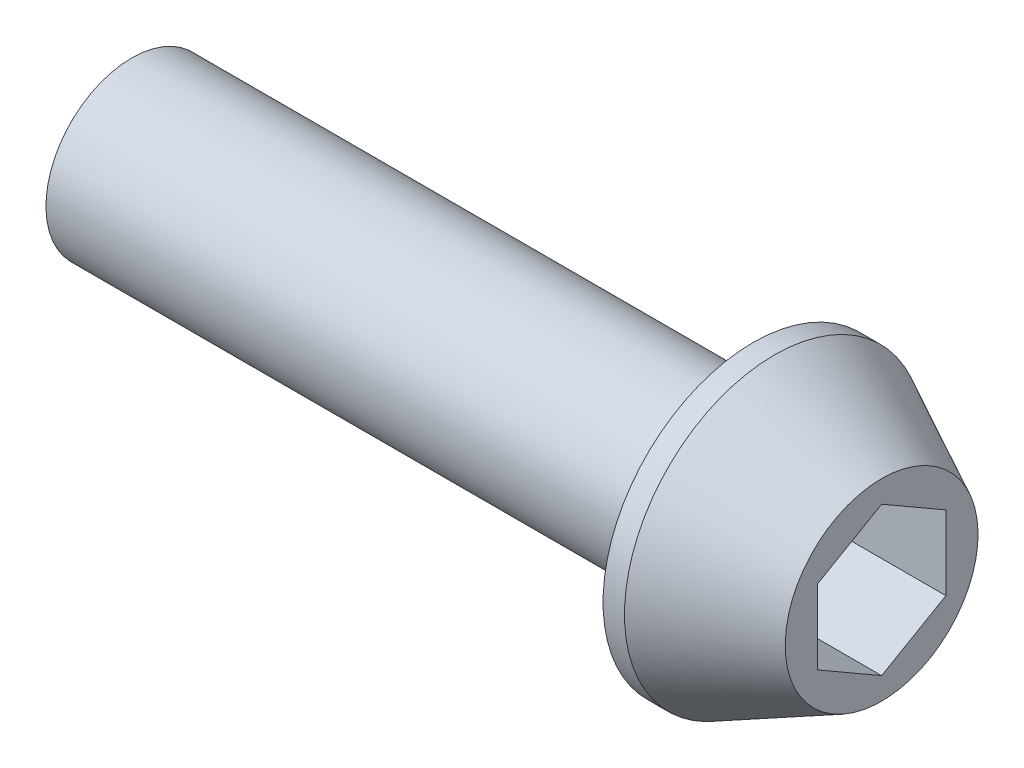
ISO-10303-21;
HEADER;
FILE_DESCRIPTION(('STEP AP214'),'2;1');
FILE_NAME('part.step','',(''),(''),'','','');
FILE_SCHEMA(('AUTOMOTIVE_DESIGN { 1 0 10303 214 1 1 1 1 }'));
ENDSEC;
DATA;
#1=APPLICATION_CONTEXT('core data for automotive mechanical design processes');
#2=APPLICATION_PROTOCOL_DEFINITION('international standard','automotive_design',2000,#1);
#3=PRODUCT_CONTEXT('',#1,'mechanical');
#4=PRODUCT('Part','Part','',(#3));
#5=PRODUCT_RELATED_PRODUCT_CATEGORY('part','',(#4));
#6=PRODUCT_DEFINITION_FORMATION('','',#4);
#7=PRODUCT_DEFINITION_CONTEXT('part definition',#1,'design');
#8=PRODUCT_DEFINITION('design','',#6,#7);
#9=PRODUCT_DEFINITION_SHAPE('','',#8);
#10=(LENGTH_UNIT() NAMED_UNIT(*) SI_UNIT(.MILLI.,.METRE.));
#11=(NAMED_UNIT(*) PLANE_ANGLE_UNIT() SI_UNIT($,.RADIAN.));
#12=(NAMED_UNIT(*) SI_UNIT($,.STERADIAN.) SOLID_ANGLE_UNIT());
#13=UNCERTAINTY_MEASURE_WITH_UNIT(LENGTH_MEASURE(1.E-05),#10,'distance_accuracy_value','');
#14=(GEOMETRIC_REPRESENTATION_CONTEXT(3) GLOBAL_UNCERTAINTY_ASSIGNED_CONTEXT((#13)) GLOBAL_UNIT_ASSIGNED_CONTEXT((#10,
#11,#12)) REPRESENTATION_CONTEXT('',''));
#15=CARTESIAN_POINT('',(0.,0.,0.));
#16=DIRECTION('',(0.,0.,1.));
#17=DIRECTION('',(1.,0.,0.));
#18=AXIS2_PLACEMENT_3D('',#15,#16,#17);
#19=CARTESIAN_POINT('',(-6.,3.,0.));
#20=DIRECTION('',(-1.,0.,0.));
#21=DIRECTION('',(0.,-1.,0.));
#22=AXIS2_PLACEMENT_3D('',#19,#20,#21);
#23=PLANE('',#22);
#24=CARTESIAN_POINT('',(-6.,0.,0.));
#25=DIRECTION('',(1.,0.,0.));
#26=DIRECTION('',(0.,1.,0.));
#27=AXIS2_PLACEMENT_3D('',#24,#25,#26);
#28=CIRCLE('',#27,3.);
#29=CARTESIAN_POINT('',(-6.,3.,0.));
#30=VERTEX_POINT('',#29);
#31=EDGE_CURVE('E133',#30,#30,#28,.T.);
#32=ORIENTED_EDGE('',*,*,#31,.F.);
#33=EDGE_LOOP('',(#32));
#34=FACE_BOUND('',#33,.T.);
#35=ADVANCED_FACE('F32',(#34),#23,.T.);
#36=CARTESIAN_POINT('',(0.,4.5,0.));
#37=DIRECTION('',(1.,0.,0.));
#38=DIRECTION('',(0.,1.,0.));
#39=AXIS2_PLACEMENT_3D('',#36,#37,#38);
#40=PLANE('',#39);
#41=DIRECTION('',(0.,0.5,0.866025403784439));
#42=VECTOR('',#41,1.);
#43=CARTESIAN_POINT('',(0.,1.73205080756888,-3.));
#44=LINE('',#43,#42);
#45=CARTESIAN_POINT('',(0.,1.73205080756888,-3.));
#46=VERTEX_POINT('',#45);
#47=CARTESIAN_POINT('',(0.,3.46410161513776,0.));
#48=VERTEX_POINT('',#47);
#49=EDGE_CURVE('E46',#46,#48,#44,.T.);
#50=ORIENTED_EDGE('',*,*,#49,.F.);
#51=DIRECTION('',(0.,1.,0.));
#52=VECTOR('',#51,1.);
#53=CARTESIAN_POINT('',(0.,-1.73205080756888,-3.));
#54=LINE('',#53,#52);
#55=CARTESIAN_POINT('',(0.,-1.73205080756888,-3.));
#56=VERTEX_POINT('',#55);
#57=EDGE_CURVE('E129',#56,#46,#54,.T.);
#58=ORIENTED_EDGE('',*,*,#57,.F.);
#59=DIRECTION('',(0.,0.5,-0.866025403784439));
#60=VECTOR('',#59,1.);
#61=CARTESIAN_POINT('',(0.,-3.46410161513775,0.));
#62=LINE('',#61,#60);
#63=CARTESIAN_POINT('',(0.,-3.46410161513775,0.));
#64=VERTEX_POINT('',#63);
#65=EDGE_CURVE('E127',#64,#56,#62,.T.);
#66=ORIENTED_EDGE('',*,*,#65,.F.);
#67=DIRECTION('',(0.,-0.5,-0.866025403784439));
#68=VECTOR('',#67,1.);
#69=CARTESIAN_POINT('',(0.,-1.73205080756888,3.));
#70=LINE('',#69,#68);
#71=CARTESIAN_POINT('',(0.,-1.73205080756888,3.));
#72=VERTEX_POINT('',#71);
#73=EDGE_CURVE('E94',#72,#64,#70,.T.);
#74=ORIENTED_EDGE('',*,*,#73,.F.);
#75=DIRECTION('',(0.,-1.,0.));
#76=VECTOR('',#75,1.);
#77=CARTESIAN_POINT('',(0.,1.73205080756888,3.));
#78=LINE('',#77,#76);
#79=CARTESIAN_POINT('',(0.,1.73205080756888,3.));
#80=VERTEX_POINT('',#79);
#81=EDGE_CURVE('E123',#80,#72,#78,.T.);
#82=ORIENTED_EDGE('',*,*,#81,.F.);
#83=DIRECTION('',(0.,-0.5,0.866025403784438));
#84=VECTOR('',#83,1.);
#85=CARTESIAN_POINT('',(0.,3.46410161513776,0.));
#86=LINE('',#85,#84);
#87=EDGE_CURVE('E120',#48,#80,#86,.T.);
#88=ORIENTED_EDGE('',*,*,#87,.F.);
#89=EDGE_LOOP('',(#50,#58,#66,#74,#82,#88));
#90=FACE_BOUND('',#89,.T.);
#91=CARTESIAN_POINT('',(0.,0.,0.));
#92=DIRECTION('',(1.,0.,0.));
#93=DIRECTION('',(0.,1.,0.));
#94=AXIS2_PLACEMENT_3D('',#91,#92,#93);
#95=CIRCLE('',#94,4.5);
#96=CARTESIAN_POINT('',(0.,4.5,0.));
#97=VERTEX_POINT('',#96);
#98=EDGE_CURVE('E11',#97,#97,#95,.T.);
#99=ORIENTED_EDGE('',*,*,#98,.T.);
#100=EDGE_LOOP('',(#99));
#101=FACE_BOUND('',#100,.T.);
#102=ADVANCED_FACE('F170',(#90,#101),#40,.T.);
#103=CARTESIAN_POINT('',(0.,0.,0.));
#104=DIRECTION('',(-1.,0.,0.));
#105=DIRECTION('',(0.,-1.,0.));
#106=AXIS2_PLACEMENT_3D('',#103,#104,#105);
#107=CONICAL_SURFACE('',#106,4.5,0.463647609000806);
#108=CARTESIAN_POINT('',(-5.,0.,0.));
#109=DIRECTION('',(1.,0.,0.));
#110=DIRECTION('',(0.,1.,0.));
#111=AXIS2_PLACEMENT_3D('',#108,#109,#110);
#112=CIRCLE('',#111,7.);
#113=CARTESIAN_POINT('',(-5.,7.,0.));
#114=VERTEX_POINT('',#113);
#115=EDGE_CURVE('E39',#114,#114,#112,.T.);
#116=ORIENTED_EDGE('',*,*,#115,.T.);
#117=EDGE_LOOP('',(#116));
#118=FACE_BOUND('',#117,.T.);
#119=ORIENTED_EDGE('',*,*,#98,.F.);
#120=EDGE_LOOP('',(#119));
#121=FACE_BOUND('',#120,.T.);
#122=ADVANCED_FACE('F155',(#118,#121),#107,.T.);
#123=CARTESIAN_POINT('',(0.,0.,0.));
#124=DIRECTION('',(1.,0.,0.));
#125=DIRECTION('',(0.,1.,0.));
#126=AXIS2_PLACEMENT_3D('',#123,#124,#125);
#127=CYLINDRICAL_SURFACE('',#126,7.);
#128=CARTESIAN_POINT('',(-6.,0.,0.));
#129=DIRECTION('',(1.,0.,0.));
#130=DIRECTION('',(0.,1.,0.));
#131=AXIS2_PLACEMENT_3D('',#128,#129,#130);
#132=CIRCLE('',#131,7.);
#133=CARTESIAN_POINT('',(-6.,7.,0.));
#134=VERTEX_POINT('',#133);
#135=EDGE_CURVE('E150',#134,#134,#132,.T.);
#136=ORIENTED_EDGE('',*,*,#135,.T.);
#137=EDGE_LOOP('',(#136));
#138=FACE_BOUND('',#137,.T.);
#139=ORIENTED_EDGE('',*,*,#115,.F.);
#140=EDGE_LOOP('',(#139));
#141=FACE_BOUND('',#140,.T.);
#142=ADVANCED_FACE('F158',(#138,#141),#127,.T.);
#143=CARTESIAN_POINT('',(-6.,3.99999999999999,0.));
#144=DIRECTION('',(-1.,0.,0.));
#145=DIRECTION('',(0.,-1.,0.));
#146=AXIS2_PLACEMENT_3D('',#143,#144,#145);
#147=PLANE('',#146);
#148=CARTESIAN_POINT('',(-6.,0.,0.));
#149=DIRECTION('',(1.,0.,0.));
#150=DIRECTION('',(0.,1.,0.));
#151=AXIS2_PLACEMENT_3D('',#148,#149,#150);
#152=CIRCLE('',#151,3.99999999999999);
#153=CARTESIAN_POINT('',(-6.,3.99999999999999,0.));
#154=VERTEX_POINT('',#153);
#155=EDGE_CURVE('E147',#154,#154,#152,.T.);
#156=ORIENTED_EDGE('',*,*,#155,.T.);
#157=EDGE_LOOP('',(#156));
#158=FACE_BOUND('',#157,.T.);
#159=ORIENTED_EDGE('',*,*,#135,.F.);
#160=EDGE_LOOP('',(#159));
#161=FACE_BOUND('',#160,.T.);
#162=ADVANCED_FACE('F160',(#158,#161),#147,.T.);
#163=CARTESIAN_POINT('',(0.,0.,0.));
#164=DIRECTION('',(1.,0.,0.));
#165=DIRECTION('',(0.,1.,0.));
#166=AXIS2_PLACEMENT_3D('',#163,#164,#165);
#167=CYLINDRICAL_SURFACE('',#166,3.99999999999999);
#168=CARTESIAN_POINT('',(-35.,0.,0.));
#169=DIRECTION('',(1.,0.,0.));
#170=DIRECTION('',(0.,1.,0.));
#171=AXIS2_PLACEMENT_3D('',#168,#169,#170);
#172=CIRCLE('',#171,4.);
#173=CARTESIAN_POINT('',(-35.,3.99999999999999,0.));
#174=VERTEX_POINT('',#173);
#175=EDGE_CURVE('E144',#174,#174,#172,.T.);
#176=ORIENTED_EDGE('',*,*,#175,.T.);
#177=EDGE_LOOP('',(#176));
#178=FACE_BOUND('',#177,.T.);
#179=ORIENTED_EDGE('',*,*,#155,.F.);
#180=EDGE_LOOP('',(#179));
#181=FACE_BOUND('',#180,.T.);
#182=ADVANCED_FACE('F167',(#178,#181),#167,.T.);
#183=CARTESIAN_POINT('',(-35.,3.99999999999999,0.));
#184=DIRECTION('',(-1.,0.,0.));
#185=DIRECTION('',(0.,-1.,0.));
#186=AXIS2_PLACEMENT_3D('',#183,#184,#185);
#187=PLANE('',#186);
#188=CARTESIAN_POINT('',(-35.,0.,0.));
#189=DIRECTION('',(1.,0.,0.));
#190=DIRECTION('',(0.,1.,0.));
#191=AXIS2_PLACEMENT_3D('',#188,#189,#190);
#192=CIRCLE('',#191,3.);
#193=CARTESIAN_POINT('',(-35.,2.99999999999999,0.));
#194=VERTEX_POINT('',#193);
#195=EDGE_CURVE('E141',#194,#194,#192,.T.);
#196=ORIENTED_EDGE('',*,*,#195,.T.);
#197=EDGE_LOOP('',(#196));
#198=FACE_BOUND('',#197,.T.);
#199=ORIENTED_EDGE('',*,*,#175,.F.);
#200=EDGE_LOOP('',(#199));
#201=FACE_BOUND('',#200,.T.);
#202=ADVANCED_FACE('F184',(#198,#201),#187,.T.);
#203=CARTESIAN_POINT('',(0.,0.,0.));
#204=DIRECTION('',(1.,0.,0.));
#205=DIRECTION('',(0.,1.,0.));
#206=AXIS2_PLACEMENT_3D('',#203,#204,#205);
#207=CYLINDRICAL_SURFACE('',#206,3.);
#208=ORIENTED_EDGE('',*,*,#31,.T.);
#209=EDGE_LOOP('',(#208));
#210=FACE_BOUND('',#209,.T.);
#211=ORIENTED_EDGE('',*,*,#195,.F.);
#212=EDGE_LOOP('',(#211));
#213=FACE_BOUND('',#212,.T.);
#214=ADVANCED_FACE('F180',(#210,#213),#207,.F.);
#215=CARTESIAN_POINT('',(-5.,1.73205080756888,-3.));
#216=DIRECTION('',(0.,0.866025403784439,-0.5));
#217=DIRECTION('',(0.,0.5,0.866025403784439));
#218=AXIS2_PLACEMENT_3D('',#215,#216,#217);
#219=PLANE('',#218);
#220=ORIENTED_EDGE('',*,*,#49,.T.);
#221=DIRECTION('',(1.,0.,0.));
#222=VECTOR('',#221,1.);
#223=CARTESIAN_POINT('',(-5.,3.46410161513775,0.));
#224=LINE('',#223,#222);
#225=CARTESIAN_POINT('',(-5.,3.46410161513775,0.));
#226=VERTEX_POINT('',#225);
#227=EDGE_CURVE('E76',#226,#48,#224,.T.);
#228=ORIENTED_EDGE('',*,*,#227,.F.);
#229=DIRECTION('',(0.,0.5,0.866025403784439));
#230=VECTOR('',#229,1.);
#231=CARTESIAN_POINT('',(-5.,1.73205080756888,-3.));
#232=LINE('',#231,#230);
#233=CARTESIAN_POINT('',(-5.,1.73205080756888,-3.));
#234=VERTEX_POINT('',#233);
#235=EDGE_CURVE('E131',#234,#226,#232,.T.);
#236=ORIENTED_EDGE('',*,*,#235,.F.);
#237=DIRECTION('',(1.,0.,0.));
#238=VECTOR('',#237,1.);
#239=CARTESIAN_POINT('',(-5.,1.73205080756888,-3.));
#240=LINE('',#239,#238);
#241=EDGE_CURVE('E54',#234,#46,#240,.T.);
#242=ORIENTED_EDGE('',*,*,#241,.T.);
#243=EDGE_LOOP('',(#220,#228,#236,#242));
#244=FACE_BOUND('',#243,.T.);
#245=ADVANCED_FACE('F183',(#244),#219,.F.);
#246=CARTESIAN_POINT('',(-5.,-1.73205080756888,-3.));
#247=DIRECTION('',(0.,0.,-1.));
#248=DIRECTION('',(0.,1.,0.));
#249=AXIS2_PLACEMENT_3D('',#246,#247,#248);
#250=PLANE('',#249);
#251=ORIENTED_EDGE('',*,*,#57,.T.);
#252=ORIENTED_EDGE('',*,*,#241,.F.);
#253=DIRECTION('',(0.,1.,0.));
#254=VECTOR('',#253,1.);
#255=CARTESIAN_POINT('',(-5.,-1.73205080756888,-3.));
#256=LINE('',#255,#254);
#257=CARTESIAN_POINT('',(-5.,-1.73205080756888,-3.));
#258=VERTEX_POINT('',#257);
#259=EDGE_CURVE('E106',#258,#234,#256,.T.);
#260=ORIENTED_EDGE('',*,*,#259,.F.);
#261=DIRECTION('',(1.,0.,0.));
#262=VECTOR('',#261,1.);
#263=CARTESIAN_POINT('',(-5.,-1.73205080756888,-3.));
#264=LINE('',#263,#262);
#265=EDGE_CURVE('E98',#258,#56,#264,.T.);
#266=ORIENTED_EDGE('',*,*,#265,.T.);
#267=EDGE_LOOP('',(#251,#252,#260,#266));
#268=FACE_BOUND('',#267,.T.);
#269=ADVANCED_FACE('F204',(#268),#250,.F.);
#270=CARTESIAN_POINT('',(-5.,-3.46410161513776,0.));
#271=DIRECTION('',(0.,-0.866025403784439,-0.5));
#272=DIRECTION('',(0.,0.5,-0.866025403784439));
#273=AXIS2_PLACEMENT_3D('',#270,#271,#272);
#274=PLANE('',#273);
#275=ORIENTED_EDGE('',*,*,#65,.T.);
#276=ORIENTED_EDGE('',*,*,#265,.F.);
#277=DIRECTION('',(0.,0.5,-0.866025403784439));
#278=VECTOR('',#277,1.);
#279=CARTESIAN_POINT('',(-5.,-3.46410161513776,0.));
#280=LINE('',#279,#278);
#281=CARTESIAN_POINT('',(-5.,-3.46410161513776,0.));
#282=VERTEX_POINT('',#281);
#283=EDGE_CURVE('E102',#282,#258,#280,.T.);
#284=ORIENTED_EDGE('',*,*,#283,.F.);
#285=DIRECTION('',(1.,0.,0.));
#286=VECTOR('',#285,1.);
#287=CARTESIAN_POINT('',(-5.,-3.46410161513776,0.));
#288=LINE('',#287,#286);
#289=EDGE_CURVE('E87',#282,#64,#288,.T.);
#290=ORIENTED_EDGE('',*,*,#289,.T.);
#291=EDGE_LOOP('',(#275,#276,#284,#290));
#292=FACE_BOUND('',#291,.T.);
#293=ADVANCED_FACE('F103',(#292),#274,.F.);
#294=CARTESIAN_POINT('',(-5.,-1.73205080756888,3.));
#295=DIRECTION('',(0.,-0.866025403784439,0.5));
#296=DIRECTION('',(0.,-0.5,-0.866025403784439));
#297=AXIS2_PLACEMENT_3D('',#294,#295,#296);
#298=PLANE('',#297);
#299=ORIENTED_EDGE('',*,*,#73,.T.);
#300=ORIENTED_EDGE('',*,*,#289,.F.);
#301=DIRECTION('',(0.,-0.5,-0.866025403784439));
#302=VECTOR('',#301,1.);
#303=CARTESIAN_POINT('',(-5.,-1.73205080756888,3.));
#304=LINE('',#303,#302);
#305=CARTESIAN_POINT('',(-5.,-1.73205080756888,3.));
#306=VERTEX_POINT('',#305);
#307=EDGE_CURVE('E91',#306,#282,#304,.T.);
#308=ORIENTED_EDGE('',*,*,#307,.F.);
#309=DIRECTION('',(1.,0.,0.));
#310=VECTOR('',#309,1.);
#311=CARTESIAN_POINT('',(-5.,-1.73205080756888,3.));
#312=LINE('',#311,#310);
#313=EDGE_CURVE('E99',#306,#72,#312,.T.);
#314=ORIENTED_EDGE('',*,*,#313,.T.);
#315=EDGE_LOOP('',(#299,#300,#308,#314));
#316=FACE_BOUND('',#315,.T.);
#317=ADVANCED_FACE('F89',(#316),#298,.F.);
#318=CARTESIAN_POINT('',(-5.,1.73205080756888,3.));
#319=DIRECTION('',(0.,0.,1.));
#320=DIRECTION('',(0.,-1.,0.));
#321=AXIS2_PLACEMENT_3D('',#318,#319,#320);
#322=PLANE('',#321);
#323=ORIENTED_EDGE('',*,*,#81,.T.);
#324=ORIENTED_EDGE('',*,*,#313,.F.);
#325=DIRECTION('',(0.,-1.,0.));
#326=VECTOR('',#325,1.);
#327=CARTESIAN_POINT('',(-5.,1.73205080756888,3.));
#328=LINE('',#327,#326);
#329=CARTESIAN_POINT('',(-5.,1.73205080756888,3.));
#330=VERTEX_POINT('',#329);
#331=EDGE_CURVE('E112',#330,#306,#328,.T.);
#332=ORIENTED_EDGE('',*,*,#331,.F.);
#333=DIRECTION('',(1.,0.,0.));
#334=VECTOR('',#333,1.);
#335=CARTESIAN_POINT('',(-5.,1.73205080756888,3.));
#336=LINE('',#335,#334);
#337=EDGE_CURVE('E136',#330,#80,#336,.T.);
#338=ORIENTED_EDGE('',*,*,#337,.T.);
#339=EDGE_LOOP('',(#323,#324,#332,#338));
#340=FACE_BOUND('',#339,.T.);
#341=ADVANCED_FACE('F208',(#340),#322,.F.);
#342=CARTESIAN_POINT('',(-5.,3.46410161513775,0.));
#343=DIRECTION('',(0.,0.866025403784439,0.5));
#344=DIRECTION('',(0.,-0.5,0.866025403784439));
#345=AXIS2_PLACEMENT_3D('',#342,#343,#344);
#346=PLANE('',#345);
#347=ORIENTED_EDGE('',*,*,#87,.T.);
#348=ORIENTED_EDGE('',*,*,#337,.F.);
#349=DIRECTION('',(0.,-0.5,0.866025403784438));
#350=VECTOR('',#349,1.);
#351=CARTESIAN_POINT('',(-5.,3.46410161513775,0.));
#352=LINE('',#351,#350);
#353=EDGE_CURVE('E114',#226,#330,#352,.T.);
#354=ORIENTED_EDGE('',*,*,#353,.F.);
#355=ORIENTED_EDGE('',*,*,#227,.T.);
#356=EDGE_LOOP('',(#347,#348,#354,#355));
#357=FACE_BOUND('',#356,.T.);
#358=ADVANCED_FACE('F205',(#357),#346,.F.);
#359=CARTESIAN_POINT('',(-5.,0.,0.));
#360=DIRECTION('',(1.,0.,0.));
#361=DIRECTION('',(0.,1.,0.));
#362=AXIS2_PLACEMENT_3D('',#359,#360,#361);
#363=PLANE('',#362);
#364=ORIENTED_EDGE('',*,*,#235,.T.);
#365=ORIENTED_EDGE('',*,*,#353,.T.);
#366=ORIENTED_EDGE('',*,*,#331,.T.);
#367=ORIENTED_EDGE('',*,*,#307,.T.);
#368=ORIENTED_EDGE('',*,*,#283,.T.);
#369=ORIENTED_EDGE('',*,*,#259,.T.);
#370=EDGE_LOOP('',(#364,#365,#366,#367,#368,#369));
#371=FACE_BOUND('',#370,.T.);
#372=ADVANCED_FACE('F109',(#371),#363,.T.);
#373=CLOSED_SHELL('',(#35,#102,#122,#142,#162,#182,#202,#214,#245,#269,#293,#317,#341,#358,#372));
#374=MANIFOLD_SOLID_BREP('B2',#373);
#375=ADVANCED_BREP_SHAPE_REPRESENTATION('',(#18,#374),#14);
#376=SHAPE_DEFINITION_REPRESENTATION(#9,#375);
ENDSEC;
END-ISO-10303-21;
